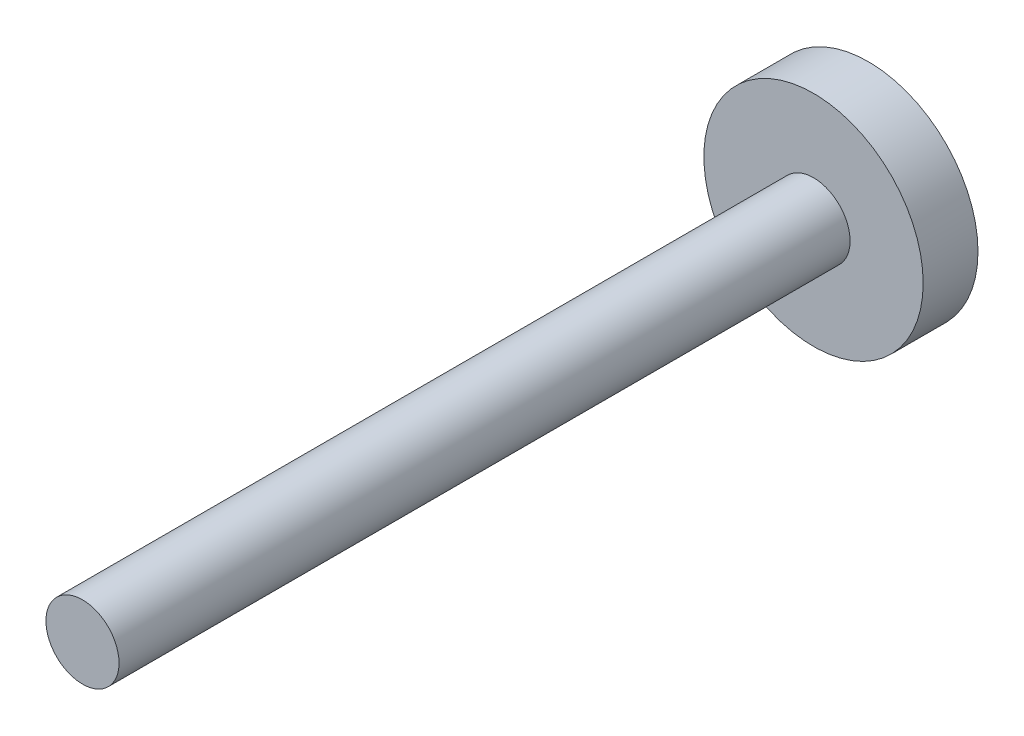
from build123d import *

# Parameters (mm, degrees)
CROQUIS1_R              = 6
SALIENTE_EXTRUIR1_DEPTH = 3
CROQUIS2_R              = 2
SALIENTE_EXTRUIR2_DEPTH = 40
CORTAR_EXTRUIR1_DEPTH   = 2


with BuildPart() as part:
    # Croquis1 → Saliente-Extruir1 (new body)
    with BuildSketch(Plane.XY):
        Circle(CROQUIS1_R)
    extrude(amount=SALIENTE_EXTRUIR1_DEPTH)

    # Croquis2 → Saliente-Extruir2 (add)
    with BuildSketch(Plane.XY.offset(3)):
        Circle(CROQUIS2_R)
    extrude(amount=SALIENTE_EXTRUIR2_DEPTH)

    # Croquis3 → Cortar-Extruir1 (cut)
    with BuildSketch(Plane(origin=(0, 0, 0), x_dir=(-1, 0, 0), z_dir=(0, 0, -1))):
        Polygon((2.267928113, -2), (2.866014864, 0.964083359), (0.598086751, 2.964083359), (-2.267928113, 2), (-2.866014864, -0.964083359), (-0.598086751, -2.964083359), align=None)
    extrude(amount=-CORTAR_EXTRUIR1_DEPTH, mode=Mode.SUBTRACT)


solid = part.part
